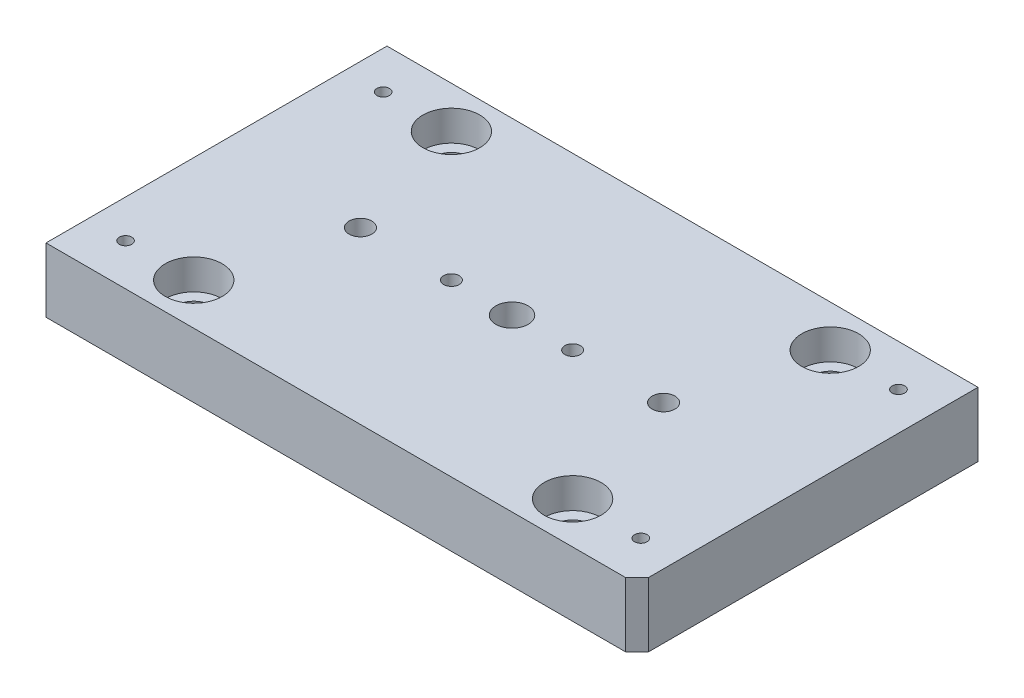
ISO-10303-21;
HEADER;
FILE_DESCRIPTION(('STEP AP214'),'2;1');
FILE_NAME('part.step','',(''),(''),'','','');
FILE_SCHEMA(('AUTOMOTIVE_DESIGN { 1 0 10303 214 1 1 1 1 }'));
ENDSEC;
DATA;
#1=APPLICATION_CONTEXT('core data for automotive mechanical design processes');
#2=APPLICATION_PROTOCOL_DEFINITION('international standard','automotive_design',2000,#1);
#3=PRODUCT_CONTEXT('',#1,'mechanical');
#4=PRODUCT('Part','Part','',(#3));
#5=PRODUCT_RELATED_PRODUCT_CATEGORY('part','',(#4));
#6=PRODUCT_DEFINITION_FORMATION('','',#4);
#7=PRODUCT_DEFINITION_CONTEXT('part definition',#1,'design');
#8=PRODUCT_DEFINITION('design','',#6,#7);
#9=PRODUCT_DEFINITION_SHAPE('','',#8);
#10=(LENGTH_UNIT() NAMED_UNIT(*) SI_UNIT(.MILLI.,.METRE.));
#11=(NAMED_UNIT(*) PLANE_ANGLE_UNIT() SI_UNIT($,.RADIAN.));
#12=(NAMED_UNIT(*) SI_UNIT($,.STERADIAN.) SOLID_ANGLE_UNIT());
#13=UNCERTAINTY_MEASURE_WITH_UNIT(LENGTH_MEASURE(1.E-05),#10,'distance_accuracy_value','');
#14=(GEOMETRIC_REPRESENTATION_CONTEXT(3) GLOBAL_UNCERTAINTY_ASSIGNED_CONTEXT((#13)) GLOBAL_UNIT_ASSIGNED_CONTEXT((#10,
#11,#12)) REPRESENTATION_CONTEXT('',''));
#15=CARTESIAN_POINT('',(0.,0.,0.));
#16=DIRECTION('',(0.,0.,1.));
#17=DIRECTION('',(1.,0.,0.));
#18=AXIS2_PLACEMENT_3D('',#15,#16,#17);
#19=CARTESIAN_POINT('',(0.,17.,0.));
#20=DIRECTION('',(0.,1.,0.));
#21=DIRECTION('',(0.,0.,1.));
#22=AXIS2_PLACEMENT_3D('',#19,#20,#21);
#23=CYLINDRICAL_SURFACE('',#22,4.24999999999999);
#24=CARTESIAN_POINT('',(0.,17.,0.));
#25=DIRECTION('',(0.,1.,0.));
#26=DIRECTION('',(0.,0.,1.));
#27=AXIS2_PLACEMENT_3D('',#24,#25,#26);
#28=CIRCLE('',#27,4.24999999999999);
#29=CARTESIAN_POINT('',(0.,17.,4.24999999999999));
#30=VERTEX_POINT('',#29);
#31=EDGE_CURVE('E163',#30,#30,#28,.T.);
#32=ORIENTED_EDGE('',*,*,#31,.T.);
#33=EDGE_LOOP('',(#32));
#34=FACE_BOUND('',#33,.T.);
#35=CARTESIAN_POINT('',(0.,4.,0.));
#36=DIRECTION('',(0.,-1.,0.));
#37=DIRECTION('',(0.,0.,-1.));
#38=AXIS2_PLACEMENT_3D('',#35,#36,#37);
#39=CIRCLE('',#38,4.24999999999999);
#40=CARTESIAN_POINT('',(0.,4.,-4.24999999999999));
#41=VERTEX_POINT('',#40);
#42=EDGE_CURVE('E170',#41,#41,#39,.F.);
#43=ORIENTED_EDGE('',*,*,#42,.F.);
#44=EDGE_LOOP('',(#43));
#45=FACE_BOUND('',#44,.T.);
#46=ADVANCED_FACE('F39',(#34,#45),#23,.F.);
#47=CARTESIAN_POINT('',(-16.,0.,0.));
#48=DIRECTION('',(0.,1.,0.));
#49=DIRECTION('',(0.,0.,1.));
#50=AXIS2_PLACEMENT_3D('',#47,#48,#49);
#51=CYLINDRICAL_SURFACE('',#50,2.05);
#52=CARTESIAN_POINT('',(-16.,17.,0.));
#53=DIRECTION('',(0.,1.,0.));
#54=DIRECTION('',(0.,0.,1.));
#55=AXIS2_PLACEMENT_3D('',#52,#53,#54);
#56=CIRCLE('',#55,2.05);
#57=CARTESIAN_POINT('',(-16.,17.,2.05));
#58=VERTEX_POINT('',#57);
#59=EDGE_CURVE('E543',#58,#58,#56,.T.);
#60=ORIENTED_EDGE('',*,*,#59,.T.);
#61=EDGE_LOOP('',(#60));
#62=FACE_BOUND('',#61,.T.);
#63=CARTESIAN_POINT('',(-16.,8.,0.));
#64=DIRECTION('',(0.,-1.,0.));
#65=DIRECTION('',(0.,0.,-1.));
#66=AXIS2_PLACEMENT_3D('',#63,#64,#65);
#67=CIRCLE('',#66,2.05);
#68=CARTESIAN_POINT('',(-16.,8.,-2.05));
#69=VERTEX_POINT('',#68);
#70=EDGE_CURVE('E165',#69,#69,#67,.F.);
#71=ORIENTED_EDGE('',*,*,#70,.F.);
#72=EDGE_LOOP('',(#71));
#73=FACE_BOUND('',#72,.T.);
#74=ADVANCED_FACE('F211',(#62,#73),#51,.F.);
#75=CARTESIAN_POINT('',(16.,0.,0.));
#76=DIRECTION('',(0.,1.,0.));
#77=DIRECTION('',(0.,0.,1.));
#78=AXIS2_PLACEMENT_3D('',#75,#76,#77);
#79=CYLINDRICAL_SURFACE('',#78,2.05);
#80=CARTESIAN_POINT('',(16.,17.,0.));
#81=DIRECTION('',(0.,1.,0.));
#82=DIRECTION('',(0.,0.,1.));
#83=AXIS2_PLACEMENT_3D('',#80,#81,#82);
#84=CIRCLE('',#83,2.05);
#85=CARTESIAN_POINT('',(16.,17.,2.05));
#86=VERTEX_POINT('',#85);
#87=EDGE_CURVE('E546',#86,#86,#84,.T.);
#88=ORIENTED_EDGE('',*,*,#87,.T.);
#89=EDGE_LOOP('',(#88));
#90=FACE_BOUND('',#89,.T.);
#91=CARTESIAN_POINT('',(16.,8.,0.));
#92=DIRECTION('',(0.,-1.,0.));
#93=DIRECTION('',(0.,0.,-1.));
#94=AXIS2_PLACEMENT_3D('',#91,#92,#93);
#95=CIRCLE('',#94,2.05);
#96=CARTESIAN_POINT('',(16.,8.,-2.05));
#97=VERTEX_POINT('',#96);
#98=EDGE_CURVE('E160',#97,#97,#95,.F.);
#99=ORIENTED_EDGE('',*,*,#98,.F.);
#100=EDGE_LOOP('',(#99));
#101=FACE_BOUND('',#100,.T.);
#102=ADVANCED_FACE('F217',(#90,#101),#79,.F.);
#103=CARTESIAN_POINT('',(-78.,17.,-45.));
#104=DIRECTION('',(1.,0.,0.));
#105=DIRECTION('',(0.,0.,-1.));
#106=AXIS2_PLACEMENT_3D('',#103,#104,#105);
#107=PLANE('',#106);
#108=DIRECTION('',(0.,0.,1.));
#109=VECTOR('',#108,1.);
#110=CARTESIAN_POINT('',(-78.,0.,-45.));
#111=LINE('',#110,#109);
#112=CARTESIAN_POINT('',(-78.,0.,-45.));
#113=VERTEX_POINT('',#112);
#114=CARTESIAN_POINT('',(-78.,0.,45.));
#115=VERTEX_POINT('',#114);
#116=EDGE_CURVE('E132',#113,#115,#111,.T.);
#117=ORIENTED_EDGE('',*,*,#116,.T.);
#118=DIRECTION('',(0.,-1.,0.));
#119=VECTOR('',#118,1.);
#120=CARTESIAN_POINT('',(-78.,17.,45.));
#121=LINE('',#120,#119);
#122=CARTESIAN_POINT('',(-78.,17.,45.));
#123=VERTEX_POINT('',#122);
#124=EDGE_CURVE('E156',#123,#115,#121,.T.);
#125=ORIENTED_EDGE('',*,*,#124,.F.);
#126=DIRECTION('',(0.,0.,1.));
#127=VECTOR('',#126,1.);
#128=CARTESIAN_POINT('',(-78.,17.,-45.));
#129=LINE('',#128,#127);
#130=CARTESIAN_POINT('',(-78.,17.,-45.));
#131=VERTEX_POINT('',#130);
#132=EDGE_CURVE('E141',#131,#123,#129,.T.);
#133=ORIENTED_EDGE('',*,*,#132,.F.);
#134=DIRECTION('',(0.,-1.,0.));
#135=VECTOR('',#134,1.);
#136=CARTESIAN_POINT('',(-78.,17.,-45.));
#137=LINE('',#136,#135);
#138=EDGE_CURVE('E150',#131,#113,#137,.T.);
#139=ORIENTED_EDGE('',*,*,#138,.T.);
#140=EDGE_LOOP('',(#117,#125,#133,#139));
#141=FACE_BOUND('',#140,.T.);
#142=ADVANCED_FACE('F193',(#141),#107,.F.);
#143=CARTESIAN_POINT('',(-78.,17.,45.));
#144=DIRECTION('',(0.,0.,-1.));
#145=DIRECTION('',(-1.,0.,0.));
#146=AXIS2_PLACEMENT_3D('',#143,#144,#145);
#147=PLANE('',#146);
#148=DIRECTION('',(1.,0.,0.));
#149=VECTOR('',#148,1.);
#150=CARTESIAN_POINT('',(-78.,0.,45.));
#151=LINE('',#150,#149);
#152=CARTESIAN_POINT('',(75.,0.,45.));
#153=VERTEX_POINT('',#152);
#154=EDGE_CURVE('E135',#115,#153,#151,.T.);
#155=ORIENTED_EDGE('',*,*,#154,.T.);
#156=DIRECTION('',(0.,1.,0.));
#157=VECTOR('',#156,1.);
#158=CARTESIAN_POINT('',(75.,17.,45.));
#159=LINE('',#158,#157);
#160=CARTESIAN_POINT('',(75.,17.,45.));
#161=VERTEX_POINT('',#160);
#162=EDGE_CURVE('E47',#153,#161,#159,.T.);
#163=ORIENTED_EDGE('',*,*,#162,.T.);
#164=DIRECTION('',(1.,0.,0.));
#165=VECTOR('',#164,1.);
#166=CARTESIAN_POINT('',(-78.,17.,45.));
#167=LINE('',#166,#165);
#168=EDGE_CURVE('E144',#123,#161,#167,.T.);
#169=ORIENTED_EDGE('',*,*,#168,.F.);
#170=ORIENTED_EDGE('',*,*,#124,.T.);
#171=EDGE_LOOP('',(#155,#163,#169,#170));
#172=FACE_BOUND('',#171,.T.);
#173=ADVANCED_FACE('F313',(#172),#147,.F.);
#174=CARTESIAN_POINT('',(78.,17.,-45.));
#175=DIRECTION('',(-1.,0.,0.));
#176=DIRECTION('',(0.,0.,1.));
#177=AXIS2_PLACEMENT_3D('',#174,#175,#176);
#178=PLANE('',#177);
#179=DIRECTION('',(0.,0.,-1.));
#180=VECTOR('',#179,1.);
#181=CARTESIAN_POINT('',(78.,17.,-45.));
#182=LINE('',#181,#180);
#183=CARTESIAN_POINT('',(78.,17.,42.));
#184=VERTEX_POINT('',#183);
#185=CARTESIAN_POINT('',(78.,17.,-45.));
#186=VERTEX_POINT('',#185);
#187=EDGE_CURVE('E146',#184,#186,#182,.T.);
#188=ORIENTED_EDGE('',*,*,#187,.F.);
#189=DIRECTION('',(0.,-1.,0.));
#190=VECTOR('',#189,1.);
#191=CARTESIAN_POINT('',(78.,17.,42.));
#192=LINE('',#191,#190);
#193=CARTESIAN_POINT('',(78.,0.,42.));
#194=VERTEX_POINT('',#193);
#195=EDGE_CURVE('E159',#184,#194,#192,.T.);
#196=ORIENTED_EDGE('',*,*,#195,.T.);
#197=DIRECTION('',(0.,0.,-1.));
#198=VECTOR('',#197,1.);
#199=CARTESIAN_POINT('',(78.,0.,-45.));
#200=LINE('',#199,#198);
#201=CARTESIAN_POINT('',(78.,0.,-45.));
#202=VERTEX_POINT('',#201);
#203=EDGE_CURVE('E137',#194,#202,#200,.T.);
#204=ORIENTED_EDGE('',*,*,#203,.T.);
#205=DIRECTION('',(0.,-1.,0.));
#206=VECTOR('',#205,1.);
#207=CARTESIAN_POINT('',(78.,17.,-45.));
#208=LINE('',#207,#206);
#209=EDGE_CURVE('E153',#186,#202,#208,.T.);
#210=ORIENTED_EDGE('',*,*,#209,.F.);
#211=EDGE_LOOP('',(#188,#196,#204,#210));
#212=FACE_BOUND('',#211,.T.);
#213=ADVANCED_FACE('F180',(#212),#178,.F.);
#214=CARTESIAN_POINT('',(-78.,17.,-45.));
#215=DIRECTION('',(0.,0.,1.));
#216=DIRECTION('',(1.,0.,0.));
#217=AXIS2_PLACEMENT_3D('',#214,#215,#216);
#218=PLANE('',#217);
#219=DIRECTION('',(-1.,0.,0.));
#220=VECTOR('',#219,1.);
#221=CARTESIAN_POINT('',(-78.,0.,-45.));
#222=LINE('',#221,#220);
#223=EDGE_CURVE('E139',#202,#113,#222,.T.);
#224=ORIENTED_EDGE('',*,*,#223,.T.);
#225=ORIENTED_EDGE('',*,*,#138,.F.);
#226=DIRECTION('',(-1.,0.,0.));
#227=VECTOR('',#226,1.);
#228=CARTESIAN_POINT('',(-78.,17.,-45.));
#229=LINE('',#228,#227);
#230=EDGE_CURVE('E148',#186,#131,#229,.T.);
#231=ORIENTED_EDGE('',*,*,#230,.F.);
#232=ORIENTED_EDGE('',*,*,#209,.T.);
#233=EDGE_LOOP('',(#224,#225,#231,#232));
#234=FACE_BOUND('',#233,.T.);
#235=ADVANCED_FACE('F189',(#234),#218,.F.);
#236=CARTESIAN_POINT('',(-78.,17.,45.));
#237=DIRECTION('',(0.,1.,0.));
#238=DIRECTION('',(0.,0.,1.));
#239=AXIS2_PLACEMENT_3D('',#236,#237,#238);
#240=PLANE('',#239);
#241=CARTESIAN_POINT('',(-40.,17.,0.));
#242=DIRECTION('',(0.,-1.,0.));
#243=DIRECTION('',(0.,0.,-1.));
#244=AXIS2_PLACEMENT_3D('',#241,#242,#243);
#245=CIRCLE('',#244,3.);
#246=CARTESIAN_POINT('',(-40.,17.,-3.));
#247=VERTEX_POINT('',#246);
#248=EDGE_CURVE('E516',#247,#247,#245,.T.);
#249=ORIENTED_EDGE('',*,*,#248,.T.);
#250=EDGE_LOOP('',(#249));
#251=FACE_BOUND('',#250,.T.);
#252=CARTESIAN_POINT('',(40.,17.,0.));
#253=DIRECTION('',(0.,-1.,0.));
#254=DIRECTION('',(0.,0.,-1.));
#255=AXIS2_PLACEMENT_3D('',#252,#253,#254);
#256=CIRCLE('',#255,3.);
#257=CARTESIAN_POINT('',(40.,17.,-3.));
#258=VERTEX_POINT('',#257);
#259=EDGE_CURVE('E524',#258,#258,#256,.T.);
#260=ORIENTED_EDGE('',*,*,#259,.T.);
#261=EDGE_LOOP('',(#260));
#262=FACE_BOUND('',#261,.T.);
#263=ORIENTED_EDGE('',*,*,#31,.F.);
#264=EDGE_LOOP('',(#263));
#265=FACE_BOUND('',#264,.T.);
#266=ORIENTED_EDGE('',*,*,#59,.F.);
#267=EDGE_LOOP('',(#266));
#268=FACE_BOUND('',#267,.T.);
#269=ORIENTED_EDGE('',*,*,#87,.F.);
#270=EDGE_LOOP('',(#269));
#271=FACE_BOUND('',#270,.T.);
#272=CARTESIAN_POINT('',(50.,17.,34.));
#273=DIRECTION('',(0.,1.,0.));
#274=DIRECTION('',(0.,0.,1.));
#275=AXIS2_PLACEMENT_3D('',#272,#273,#274);
#276=CIRCLE('',#275,7.5);
#277=CARTESIAN_POINT('',(50.,17.,41.5));
#278=VERTEX_POINT('',#277);
#279=EDGE_CURVE('E549',#278,#278,#276,.T.);
#280=ORIENTED_EDGE('',*,*,#279,.F.);
#281=EDGE_LOOP('',(#280));
#282=FACE_BOUND('',#281,.T.);
#283=CARTESIAN_POINT('',(50.,17.,-34.));
#284=DIRECTION('',(0.,1.,0.));
#285=DIRECTION('',(0.,0.,1.));
#286=AXIS2_PLACEMENT_3D('',#283,#284,#285);
#287=CIRCLE('',#286,7.5);
#288=CARTESIAN_POINT('',(50.,17.,-26.5));
#289=VERTEX_POINT('',#288);
#290=EDGE_CURVE('E561',#289,#289,#287,.T.);
#291=ORIENTED_EDGE('',*,*,#290,.F.);
#292=EDGE_LOOP('',(#291));
#293=FACE_BOUND('',#292,.T.);
#294=CARTESIAN_POINT('',(-50.,17.,-34.));
#295=DIRECTION('',(0.,1.,0.));
#296=DIRECTION('',(0.,0.,1.));
#297=AXIS2_PLACEMENT_3D('',#294,#295,#296);
#298=CIRCLE('',#297,7.5);
#299=CARTESIAN_POINT('',(-50.,17.,-26.5));
#300=VERTEX_POINT('',#299);
#301=EDGE_CURVE('E573',#300,#300,#298,.T.);
#302=ORIENTED_EDGE('',*,*,#301,.F.);
#303=EDGE_LOOP('',(#302));
#304=FACE_BOUND('',#303,.T.);
#305=CARTESIAN_POINT('',(-50.,17.,34.));
#306=DIRECTION('',(0.,1.,0.));
#307=DIRECTION('',(0.,0.,1.));
#308=AXIS2_PLACEMENT_3D('',#305,#306,#307);
#309=CIRCLE('',#308,7.5);
#310=CARTESIAN_POINT('',(-50.,17.,41.5));
#311=VERTEX_POINT('',#310);
#312=EDGE_CURVE('E585',#311,#311,#309,.T.);
#313=ORIENTED_EDGE('',*,*,#312,.F.);
#314=EDGE_LOOP('',(#313));
#315=FACE_BOUND('',#314,.T.);
#316=CARTESIAN_POINT('',(68.,17.,34.));
#317=DIRECTION('',(0.,1.,0.));
#318=DIRECTION('',(0.,0.,1.));
#319=AXIS2_PLACEMENT_3D('',#316,#317,#318);
#320=CIRCLE('',#319,1.65);
#321=CARTESIAN_POINT('',(68.,17.,35.65));
#322=VERTEX_POINT('',#321);
#323=EDGE_CURVE('E104',#322,#322,#320,.T.);
#324=ORIENTED_EDGE('',*,*,#323,.F.);
#325=EDGE_LOOP('',(#324));
#326=FACE_BOUND('',#325,.T.);
#327=CARTESIAN_POINT('',(68.,17.,-34.));
#328=DIRECTION('',(0.,1.,0.));
#329=DIRECTION('',(0.,0.,1.));
#330=AXIS2_PLACEMENT_3D('',#327,#328,#329);
#331=CIRCLE('',#330,1.65);
#332=CARTESIAN_POINT('',(68.,17.,-32.35));
#333=VERTEX_POINT('',#332);
#334=EDGE_CURVE('E117',#333,#333,#331,.T.);
#335=ORIENTED_EDGE('',*,*,#334,.F.);
#336=EDGE_LOOP('',(#335));
#337=FACE_BOUND('',#336,.T.);
#338=CARTESIAN_POINT('',(-68.,17.,-34.));
#339=DIRECTION('',(0.,1.,0.));
#340=DIRECTION('',(0.,0.,1.));
#341=AXIS2_PLACEMENT_3D('',#338,#339,#340);
#342=CIRCLE('',#341,1.65);
#343=CARTESIAN_POINT('',(-68.,17.,-32.35));
#344=VERTEX_POINT('',#343);
#345=EDGE_CURVE('E123',#344,#344,#342,.T.);
#346=ORIENTED_EDGE('',*,*,#345,.F.);
#347=EDGE_LOOP('',(#346));
#348=FACE_BOUND('',#347,.T.);
#349=CARTESIAN_POINT('',(-68.,17.,34.));
#350=DIRECTION('',(0.,1.,0.));
#351=DIRECTION('',(0.,0.,1.));
#352=AXIS2_PLACEMENT_3D('',#349,#350,#351);
#353=CIRCLE('',#352,1.65);
#354=CARTESIAN_POINT('',(-68.,17.,35.65));
#355=VERTEX_POINT('',#354);
#356=EDGE_CURVE('E129',#355,#355,#353,.T.);
#357=ORIENTED_EDGE('',*,*,#356,.F.);
#358=EDGE_LOOP('',(#357));
#359=FACE_BOUND('',#358,.T.);
#360=ORIENTED_EDGE('',*,*,#168,.T.);
#361=DIRECTION('',(-0.707106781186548,0.,0.707106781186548));
#362=VECTOR('',#361,1.);
#363=CARTESIAN_POINT('',(-1.5,17.,121.5));
#364=LINE('',#363,#362);
#365=EDGE_CURVE('E11',#161,#184,#364,.F.);
#366=ORIENTED_EDGE('',*,*,#365,.T.);
#367=ORIENTED_EDGE('',*,*,#187,.T.);
#368=ORIENTED_EDGE('',*,*,#230,.T.);
#369=ORIENTED_EDGE('',*,*,#132,.T.);
#370=EDGE_LOOP('',(#360,#366,#367,#368,#369));
#371=FACE_BOUND('',#370,.T.);
#372=ADVANCED_FACE('F196',(#251,#262,#265,#268,#271,#282,#293,#304,#315,#326,#337,#348,#359,
#371),#240,.T.);
#373=CARTESIAN_POINT('',(-78.,0.,45.));
#374=DIRECTION('',(0.,1.,0.));
#375=DIRECTION('',(0.,0.,1.));
#376=AXIS2_PLACEMENT_3D('',#373,#374,#375);
#377=PLANE('',#376);
#378=CARTESIAN_POINT('',(-40.,0.,0.));
#379=DIRECTION('',(0.,-1.,0.));
#380=DIRECTION('',(0.,0.,-1.));
#381=AXIS2_PLACEMENT_3D('',#378,#379,#380);
#382=CIRCLE('',#381,3.);
#383=CARTESIAN_POINT('',(-40.,0.,-3.));
#384=VERTEX_POINT('',#383);
#385=EDGE_CURVE('E519',#384,#384,#382,.T.);
#386=ORIENTED_EDGE('',*,*,#385,.F.);
#387=EDGE_LOOP('',(#386));
#388=FACE_BOUND('',#387,.T.);
#389=CARTESIAN_POINT('',(40.,0.,0.));
#390=DIRECTION('',(0.,-1.,0.));
#391=DIRECTION('',(0.,0.,-1.));
#392=AXIS2_PLACEMENT_3D('',#389,#390,#391);
#393=CIRCLE('',#392,3.);
#394=CARTESIAN_POINT('',(40.,0.,-3.));
#395=VERTEX_POINT('',#394);
#396=EDGE_CURVE('E521',#395,#395,#393,.T.);
#397=ORIENTED_EDGE('',*,*,#396,.F.);
#398=EDGE_LOOP('',(#397));
#399=FACE_BOUND('',#398,.T.);
#400=CARTESIAN_POINT('',(0.,0.,0.));
#401=DIRECTION('',(0.,-1.,0.));
#402=DIRECTION('',(0.,0.,-1.));
#403=AXIS2_PLACEMENT_3D('',#400,#401,#402);
#404=CIRCLE('',#403,6.75);
#405=CARTESIAN_POINT('',(0.,0.,-6.75));
#406=VERTEX_POINT('',#405);
#407=EDGE_CURVE('E527',#406,#406,#404,.T.);
#408=ORIENTED_EDGE('',*,*,#407,.F.);
#409=EDGE_LOOP('',(#408));
#410=FACE_BOUND('',#409,.T.);
#411=CARTESIAN_POINT('',(-16.,0.,0.));
#412=DIRECTION('',(0.,-1.,0.));
#413=DIRECTION('',(0.,0.,-1.));
#414=AXIS2_PLACEMENT_3D('',#411,#412,#413);
#415=CIRCLE('',#414,4.5);
#416=CARTESIAN_POINT('',(-16.,0.,-4.5));
#417=VERTEX_POINT('',#416);
#418=EDGE_CURVE('E173',#417,#417,#415,.T.);
#419=ORIENTED_EDGE('',*,*,#418,.F.);
#420=EDGE_LOOP('',(#419));
#421=FACE_BOUND('',#420,.T.);
#422=CARTESIAN_POINT('',(16.,0.,0.));
#423=DIRECTION('',(0.,-1.,0.));
#424=DIRECTION('',(0.,0.,-1.));
#425=AXIS2_PLACEMENT_3D('',#422,#423,#424);
#426=CIRCLE('',#425,4.5);
#427=CARTESIAN_POINT('',(16.,0.,-4.5));
#428=VERTEX_POINT('',#427);
#429=EDGE_CURVE('E168',#428,#428,#426,.T.);
#430=ORIENTED_EDGE('',*,*,#429,.F.);
#431=EDGE_LOOP('',(#430));
#432=FACE_BOUND('',#431,.T.);
#433=CARTESIAN_POINT('',(50.,0.,34.));
#434=DIRECTION('',(0.,1.,0.));
#435=DIRECTION('',(0.,0.,1.));
#436=AXIS2_PLACEMENT_3D('',#433,#434,#435);
#437=CIRCLE('',#436,4.5);
#438=CARTESIAN_POINT('',(50.,0.,38.5));
#439=VERTEX_POINT('',#438);
#440=EDGE_CURVE('E558',#439,#439,#437,.T.);
#441=ORIENTED_EDGE('',*,*,#440,.T.);
#442=EDGE_LOOP('',(#441));
#443=FACE_BOUND('',#442,.T.);
#444=CARTESIAN_POINT('',(50.,0.,-34.));
#445=DIRECTION('',(0.,1.,0.));
#446=DIRECTION('',(0.,0.,1.));
#447=AXIS2_PLACEMENT_3D('',#444,#445,#446);
#448=CIRCLE('',#447,4.5);
#449=CARTESIAN_POINT('',(50.,0.,-29.5));
#450=VERTEX_POINT('',#449);
#451=EDGE_CURVE('E570',#450,#450,#448,.T.);
#452=ORIENTED_EDGE('',*,*,#451,.T.);
#453=EDGE_LOOP('',(#452));
#454=FACE_BOUND('',#453,.T.);
#455=CARTESIAN_POINT('',(-50.,0.,-34.));
#456=DIRECTION('',(0.,1.,0.));
#457=DIRECTION('',(0.,0.,1.));
#458=AXIS2_PLACEMENT_3D('',#455,#456,#457);
#459=CIRCLE('',#458,4.5);
#460=CARTESIAN_POINT('',(-50.,0.,-29.5));
#461=VERTEX_POINT('',#460);
#462=EDGE_CURVE('E582',#461,#461,#459,.T.);
#463=ORIENTED_EDGE('',*,*,#462,.T.);
#464=EDGE_LOOP('',(#463));
#465=FACE_BOUND('',#464,.T.);
#466=CARTESIAN_POINT('',(-50.,0.,34.));
#467=DIRECTION('',(0.,1.,0.));
#468=DIRECTION('',(0.,0.,1.));
#469=AXIS2_PLACEMENT_3D('',#466,#467,#468);
#470=CIRCLE('',#469,4.5);
#471=CARTESIAN_POINT('',(-50.,0.,38.5));
#472=VERTEX_POINT('',#471);
#473=EDGE_CURVE('E105',#472,#472,#470,.T.);
#474=ORIENTED_EDGE('',*,*,#473,.T.);
#475=EDGE_LOOP('',(#474));
#476=FACE_BOUND('',#475,.T.);
#477=ORIENTED_EDGE('',*,*,#203,.F.);
#478=DIRECTION('',(0.707106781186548,0.,-0.707106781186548));
#479=VECTOR('',#478,1.);
#480=CARTESIAN_POINT('',(78.,0.,42.));
#481=LINE('',#480,#479);
#482=EDGE_CURVE('E61',#194,#153,#481,.F.);
#483=ORIENTED_EDGE('',*,*,#482,.T.);
#484=ORIENTED_EDGE('',*,*,#154,.F.);
#485=ORIENTED_EDGE('',*,*,#116,.F.);
#486=ORIENTED_EDGE('',*,*,#223,.F.);
#487=EDGE_LOOP('',(#477,#483,#484,#485,#486));
#488=FACE_BOUND('',#487,.T.);
#489=ADVANCED_FACE('F185',(#388,#399,#410,#421,#432,#443,#454,#465,#476,#488),#377,.F.);
#490=CARTESIAN_POINT('',(-68.,17.,34.));
#491=DIRECTION('',(0.,1.,0.));
#492=DIRECTION('',(0.,0.,1.));
#493=AXIS2_PLACEMENT_3D('',#490,#491,#492);
#494=CYLINDRICAL_SURFACE('',#493,1.65);
#495=CARTESIAN_POINT('',(-68.,6.9,34.));
#496=DIRECTION('',(0.,1.,0.));
#497=DIRECTION('',(0.,0.,1.));
#498=AXIS2_PLACEMENT_3D('',#495,#496,#497);
#499=CIRCLE('',#498,1.65);
#500=CARTESIAN_POINT('',(-68.,6.9,35.65));
#501=VERTEX_POINT('',#500);
#502=EDGE_CURVE('E126',#501,#501,#499,.T.);
#503=ORIENTED_EDGE('',*,*,#502,.F.);
#504=EDGE_LOOP('',(#503));
#505=FACE_BOUND('',#504,.T.);
#506=ORIENTED_EDGE('',*,*,#356,.T.);
#507=EDGE_LOOP('',(#506));
#508=FACE_BOUND('',#507,.T.);
#509=ADVANCED_FACE('F298',(#505,#508),#494,.F.);
#510=CARTESIAN_POINT('',(-68.,6.9,34.));
#511=DIRECTION('',(0.,1.,0.));
#512=DIRECTION('',(0.,0.,1.));
#513=AXIS2_PLACEMENT_3D('',#510,#511,#512);
#514=CONICAL_SURFACE('',#513,1.65,1.02974425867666);
#515=CARTESIAN_POINT('',(-68.,5.90857997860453,34.));
#516=VERTEX_POINT('',#515);
#517=VERTEX_LOOP('',#516);
#518=FACE_BOUND('',#517,.T.);
#519=ORIENTED_EDGE('',*,*,#502,.T.);
#520=EDGE_LOOP('',(#519));
#521=FACE_BOUND('',#520,.T.);
#522=ADVANCED_FACE('F294',(#518,#521),#514,.F.);
#523=CARTESIAN_POINT('',(-68.,17.,-34.));
#524=DIRECTION('',(0.,1.,0.));
#525=DIRECTION('',(0.,0.,1.));
#526=AXIS2_PLACEMENT_3D('',#523,#524,#525);
#527=CYLINDRICAL_SURFACE('',#526,1.65);
#528=CARTESIAN_POINT('',(-68.,6.9,-34.));
#529=DIRECTION('',(0.,1.,0.));
#530=DIRECTION('',(0.,0.,1.));
#531=AXIS2_PLACEMENT_3D('',#528,#529,#530);
#532=CIRCLE('',#531,1.65);
#533=CARTESIAN_POINT('',(-68.,6.9,-32.35));
#534=VERTEX_POINT('',#533);
#535=EDGE_CURVE('E120',#534,#534,#532,.T.);
#536=ORIENTED_EDGE('',*,*,#535,.F.);
#537=EDGE_LOOP('',(#536));
#538=FACE_BOUND('',#537,.T.);
#539=ORIENTED_EDGE('',*,*,#345,.T.);
#540=EDGE_LOOP('',(#539));
#541=FACE_BOUND('',#540,.T.);
#542=ADVANCED_FACE('F290',(#538,#541),#527,.F.);
#543=CARTESIAN_POINT('',(-68.,6.9,-34.));
#544=DIRECTION('',(0.,1.,0.));
#545=DIRECTION('',(0.,0.,1.));
#546=AXIS2_PLACEMENT_3D('',#543,#544,#545);
#547=CONICAL_SURFACE('',#546,1.65,1.02974425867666);
#548=CARTESIAN_POINT('',(-68.,5.90857997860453,-34.));
#549=VERTEX_POINT('',#548);
#550=VERTEX_LOOP('',#549);
#551=FACE_BOUND('',#550,.T.);
#552=ORIENTED_EDGE('',*,*,#535,.T.);
#553=EDGE_LOOP('',(#552));
#554=FACE_BOUND('',#553,.T.);
#555=ADVANCED_FACE('F286',(#551,#554),#547,.F.);
#556=CARTESIAN_POINT('',(68.,17.,-34.));
#557=DIRECTION('',(0.,1.,0.));
#558=DIRECTION('',(0.,0.,1.));
#559=AXIS2_PLACEMENT_3D('',#556,#557,#558);
#560=CYLINDRICAL_SURFACE('',#559,1.65);
#561=CARTESIAN_POINT('',(68.,6.9,-34.));
#562=DIRECTION('',(0.,1.,0.));
#563=DIRECTION('',(0.,0.,1.));
#564=AXIS2_PLACEMENT_3D('',#561,#562,#563);
#565=CIRCLE('',#564,1.65);
#566=CARTESIAN_POINT('',(68.,6.9,-32.35));
#567=VERTEX_POINT('',#566);
#568=EDGE_CURVE('E108',#567,#567,#565,.T.);
#569=ORIENTED_EDGE('',*,*,#568,.F.);
#570=EDGE_LOOP('',(#569));
#571=FACE_BOUND('',#570,.T.);
#572=ORIENTED_EDGE('',*,*,#334,.T.);
#573=EDGE_LOOP('',(#572));
#574=FACE_BOUND('',#573,.T.);
#575=ADVANCED_FACE('F282',(#571,#574),#560,.F.);
#576=CARTESIAN_POINT('',(68.,6.9,-34.));
#577=DIRECTION('',(0.,1.,0.));
#578=DIRECTION('',(0.,0.,1.));
#579=AXIS2_PLACEMENT_3D('',#576,#577,#578);
#580=CONICAL_SURFACE('',#579,1.65,1.02974425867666);
#581=CARTESIAN_POINT('',(68.,5.90857997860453,-34.));
#582=VERTEX_POINT('',#581);
#583=VERTEX_LOOP('',#582);
#584=FACE_BOUND('',#583,.T.);
#585=ORIENTED_EDGE('',*,*,#568,.T.);
#586=EDGE_LOOP('',(#585));
#587=FACE_BOUND('',#586,.T.);
#588=ADVANCED_FACE('F279',(#584,#587),#580,.F.);
#589=CARTESIAN_POINT('',(68.,17.,34.));
#590=DIRECTION('',(0.,1.,0.));
#591=DIRECTION('',(0.,0.,1.));
#592=AXIS2_PLACEMENT_3D('',#589,#590,#591);
#593=CYLINDRICAL_SURFACE('',#592,1.65);
#594=CARTESIAN_POINT('',(68.,6.9,34.));
#595=DIRECTION('',(0.,1.,0.));
#596=DIRECTION('',(0.,0.,1.));
#597=AXIS2_PLACEMENT_3D('',#594,#595,#596);
#598=CIRCLE('',#597,1.65);
#599=CARTESIAN_POINT('',(68.,6.9,35.65));
#600=VERTEX_POINT('',#599);
#601=EDGE_CURVE('E102',#600,#600,#598,.T.);
#602=ORIENTED_EDGE('',*,*,#601,.F.);
#603=EDGE_LOOP('',(#602));
#604=FACE_BOUND('',#603,.T.);
#605=ORIENTED_EDGE('',*,*,#323,.T.);
#606=EDGE_LOOP('',(#605));
#607=FACE_BOUND('',#606,.T.);
#608=ADVANCED_FACE('F98',(#604,#607),#593,.F.);
#609=CARTESIAN_POINT('',(68.,6.9,34.));
#610=DIRECTION('',(0.,1.,0.));
#611=DIRECTION('',(0.,0.,1.));
#612=AXIS2_PLACEMENT_3D('',#609,#610,#611);
#613=CONICAL_SURFACE('',#612,1.65,1.02974425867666);
#614=CARTESIAN_POINT('',(68.,5.90857997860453,34.));
#615=VERTEX_POINT('',#614);
#616=VERTEX_LOOP('',#615);
#617=FACE_BOUND('',#616,.T.);
#618=ORIENTED_EDGE('',*,*,#601,.T.);
#619=EDGE_LOOP('',(#618));
#620=FACE_BOUND('',#619,.T.);
#621=ADVANCED_FACE('F94',(#617,#620),#613,.F.);
#622=CARTESIAN_POINT('',(-50.,17.,34.));
#623=DIRECTION('',(0.,1.,0.));
#624=DIRECTION('',(0.,0.,1.));
#625=AXIS2_PLACEMENT_3D('',#622,#623,#624);
#626=CYLINDRICAL_SURFACE('',#625,4.5);
#627=ORIENTED_EDGE('',*,*,#473,.F.);
#628=EDGE_LOOP('',(#627));
#629=FACE_BOUND('',#628,.T.);
#630=CARTESIAN_POINT('',(-50.,9.,34.));
#631=DIRECTION('',(0.,1.,0.));
#632=DIRECTION('',(0.,0.,1.));
#633=AXIS2_PLACEMENT_3D('',#630,#631,#632);
#634=CIRCLE('',#633,4.5);
#635=CARTESIAN_POINT('',(-50.,9.,38.5));
#636=VERTEX_POINT('',#635);
#637=EDGE_CURVE('E111',#636,#636,#634,.T.);
#638=ORIENTED_EDGE('',*,*,#637,.T.);
#639=EDGE_LOOP('',(#638));
#640=FACE_BOUND('',#639,.T.);
#641=ADVANCED_FACE('F97',(#629,#640),#626,.F.);
#642=CARTESIAN_POINT('',(-45.5,9.,34.));
#643=DIRECTION('',(0.,-1.,0.));
#644=DIRECTION('',(0.,0.,-1.));
#645=AXIS2_PLACEMENT_3D('',#642,#643,#644);
#646=PLANE('',#645);
#647=ORIENTED_EDGE('',*,*,#637,.F.);
#648=EDGE_LOOP('',(#647));
#649=FACE_BOUND('',#648,.T.);
#650=CARTESIAN_POINT('',(-50.,9.,34.));
#651=DIRECTION('',(0.,1.,0.));
#652=DIRECTION('',(0.,0.,1.));
#653=AXIS2_PLACEMENT_3D('',#650,#651,#652);
#654=CIRCLE('',#653,7.5);
#655=CARTESIAN_POINT('',(-50.,9.,41.5));
#656=VERTEX_POINT('',#655);
#657=EDGE_CURVE('E588',#656,#656,#654,.T.);
#658=ORIENTED_EDGE('',*,*,#657,.T.);
#659=EDGE_LOOP('',(#658));
#660=FACE_BOUND('',#659,.T.);
#661=ADVANCED_FACE('F269',(#649,#660),#646,.F.);
#662=CARTESIAN_POINT('',(-50.,17.,34.));
#663=DIRECTION('',(0.,1.,0.));
#664=DIRECTION('',(0.,0.,1.));
#665=AXIS2_PLACEMENT_3D('',#662,#663,#664);
#666=CYLINDRICAL_SURFACE('',#665,7.5);
#667=ORIENTED_EDGE('',*,*,#657,.F.);
#668=EDGE_LOOP('',(#667));
#669=FACE_BOUND('',#668,.T.);
#670=ORIENTED_EDGE('',*,*,#312,.T.);
#671=EDGE_LOOP('',(#670));
#672=FACE_BOUND('',#671,.T.);
#673=ADVANCED_FACE('F265',(#669,#672),#666,.F.);
#674=CARTESIAN_POINT('',(-50.,17.,-34.));
#675=DIRECTION('',(0.,1.,0.));
#676=DIRECTION('',(0.,0.,1.));
#677=AXIS2_PLACEMENT_3D('',#674,#675,#676);
#678=CYLINDRICAL_SURFACE('',#677,4.5);
#679=ORIENTED_EDGE('',*,*,#462,.F.);
#680=EDGE_LOOP('',(#679));
#681=FACE_BOUND('',#680,.T.);
#682=CARTESIAN_POINT('',(-50.,9.,-34.));
#683=DIRECTION('',(0.,1.,0.));
#684=DIRECTION('',(0.,0.,1.));
#685=AXIS2_PLACEMENT_3D('',#682,#683,#684);
#686=CIRCLE('',#685,4.5);
#687=CARTESIAN_POINT('',(-50.,9.,-29.5));
#688=VERTEX_POINT('',#687);
#689=EDGE_CURVE('E579',#688,#688,#686,.T.);
#690=ORIENTED_EDGE('',*,*,#689,.T.);
#691=EDGE_LOOP('',(#690));
#692=FACE_BOUND('',#691,.T.);
#693=ADVANCED_FACE('F261',(#681,#692),#678,.F.);
#694=CARTESIAN_POINT('',(-45.5,9.,-34.));
#695=DIRECTION('',(0.,-1.,0.));
#696=DIRECTION('',(0.,0.,-1.));
#697=AXIS2_PLACEMENT_3D('',#694,#695,#696);
#698=PLANE('',#697);
#699=ORIENTED_EDGE('',*,*,#689,.F.);
#700=EDGE_LOOP('',(#699));
#701=FACE_BOUND('',#700,.T.);
#702=CARTESIAN_POINT('',(-50.,9.,-34.));
#703=DIRECTION('',(0.,1.,0.));
#704=DIRECTION('',(0.,0.,1.));
#705=AXIS2_PLACEMENT_3D('',#702,#703,#704);
#706=CIRCLE('',#705,7.5);
#707=CARTESIAN_POINT('',(-50.,9.,-26.5));
#708=VERTEX_POINT('',#707);
#709=EDGE_CURVE('E576',#708,#708,#706,.T.);
#710=ORIENTED_EDGE('',*,*,#709,.T.);
#711=EDGE_LOOP('',(#710));
#712=FACE_BOUND('',#711,.T.);
#713=ADVANCED_FACE('F257',(#701,#712),#698,.F.);
#714=CARTESIAN_POINT('',(-50.,17.,-34.));
#715=DIRECTION('',(0.,1.,0.));
#716=DIRECTION('',(0.,0.,1.));
#717=AXIS2_PLACEMENT_3D('',#714,#715,#716);
#718=CYLINDRICAL_SURFACE('',#717,7.5);
#719=ORIENTED_EDGE('',*,*,#709,.F.);
#720=EDGE_LOOP('',(#719));
#721=FACE_BOUND('',#720,.T.);
#722=ORIENTED_EDGE('',*,*,#301,.T.);
#723=EDGE_LOOP('',(#722));
#724=FACE_BOUND('',#723,.T.);
#725=ADVANCED_FACE('F253',(#721,#724),#718,.F.);
#726=CARTESIAN_POINT('',(50.,17.,-34.));
#727=DIRECTION('',(0.,1.,0.));
#728=DIRECTION('',(0.,0.,1.));
#729=AXIS2_PLACEMENT_3D('',#726,#727,#728);
#730=CYLINDRICAL_SURFACE('',#729,4.5);
#731=ORIENTED_EDGE('',*,*,#451,.F.);
#732=EDGE_LOOP('',(#731));
#733=FACE_BOUND('',#732,.T.);
#734=CARTESIAN_POINT('',(50.,9.,-34.));
#735=DIRECTION('',(0.,1.,0.));
#736=DIRECTION('',(0.,0.,1.));
#737=AXIS2_PLACEMENT_3D('',#734,#735,#736);
#738=CIRCLE('',#737,4.5);
#739=CARTESIAN_POINT('',(50.,9.,-29.5));
#740=VERTEX_POINT('',#739);
#741=EDGE_CURVE('E567',#740,#740,#738,.T.);
#742=ORIENTED_EDGE('',*,*,#741,.T.);
#743=EDGE_LOOP('',(#742));
#744=FACE_BOUND('',#743,.T.);
#745=ADVANCED_FACE('F249',(#733,#744),#730,.F.);
#746=CARTESIAN_POINT('',(54.5,9.,-34.));
#747=DIRECTION('',(0.,-1.,0.));
#748=DIRECTION('',(0.,0.,-1.));
#749=AXIS2_PLACEMENT_3D('',#746,#747,#748);
#750=PLANE('',#749);
#751=ORIENTED_EDGE('',*,*,#741,.F.);
#752=EDGE_LOOP('',(#751));
#753=FACE_BOUND('',#752,.T.);
#754=CARTESIAN_POINT('',(50.,9.,-34.));
#755=DIRECTION('',(0.,1.,0.));
#756=DIRECTION('',(0.,0.,1.));
#757=AXIS2_PLACEMENT_3D('',#754,#755,#756);
#758=CIRCLE('',#757,7.5);
#759=CARTESIAN_POINT('',(50.,9.,-26.5));
#760=VERTEX_POINT('',#759);
#761=EDGE_CURVE('E564',#760,#760,#758,.T.);
#762=ORIENTED_EDGE('',*,*,#761,.T.);
#763=EDGE_LOOP('',(#762));
#764=FACE_BOUND('',#763,.T.);
#765=ADVANCED_FACE('F245',(#753,#764),#750,.F.);
#766=CARTESIAN_POINT('',(50.,17.,-34.));
#767=DIRECTION('',(0.,1.,0.));
#768=DIRECTION('',(0.,0.,1.));
#769=AXIS2_PLACEMENT_3D('',#766,#767,#768);
#770=CYLINDRICAL_SURFACE('',#769,7.5);
#771=ORIENTED_EDGE('',*,*,#761,.F.);
#772=EDGE_LOOP('',(#771));
#773=FACE_BOUND('',#772,.T.);
#774=ORIENTED_EDGE('',*,*,#290,.T.);
#775=EDGE_LOOP('',(#774));
#776=FACE_BOUND('',#775,.T.);
#777=ADVANCED_FACE('F241',(#773,#776),#770,.F.);
#778=CARTESIAN_POINT('',(50.,17.,34.));
#779=DIRECTION('',(0.,1.,0.));
#780=DIRECTION('',(0.,0.,1.));
#781=AXIS2_PLACEMENT_3D('',#778,#779,#780);
#782=CYLINDRICAL_SURFACE('',#781,4.5);
#783=ORIENTED_EDGE('',*,*,#440,.F.);
#784=EDGE_LOOP('',(#783));
#785=FACE_BOUND('',#784,.T.);
#786=CARTESIAN_POINT('',(50.,9.,34.));
#787=DIRECTION('',(0.,1.,0.));
#788=DIRECTION('',(0.,0.,1.));
#789=AXIS2_PLACEMENT_3D('',#786,#787,#788);
#790=CIRCLE('',#789,4.5);
#791=CARTESIAN_POINT('',(50.,9.,38.5));
#792=VERTEX_POINT('',#791);
#793=EDGE_CURVE('E555',#792,#792,#790,.T.);
#794=ORIENTED_EDGE('',*,*,#793,.T.);
#795=EDGE_LOOP('',(#794));
#796=FACE_BOUND('',#795,.T.);
#797=ADVANCED_FACE('F237',(#785,#796),#782,.F.);
#798=CARTESIAN_POINT('',(54.5,9.,34.));
#799=DIRECTION('',(0.,-1.,0.));
#800=DIRECTION('',(0.,0.,-1.));
#801=AXIS2_PLACEMENT_3D('',#798,#799,#800);
#802=PLANE('',#801);
#803=ORIENTED_EDGE('',*,*,#793,.F.);
#804=EDGE_LOOP('',(#803));
#805=FACE_BOUND('',#804,.T.);
#806=CARTESIAN_POINT('',(50.,9.,34.));
#807=DIRECTION('',(0.,1.,0.));
#808=DIRECTION('',(0.,0.,1.));
#809=AXIS2_PLACEMENT_3D('',#806,#807,#808);
#810=CIRCLE('',#809,7.5);
#811=CARTESIAN_POINT('',(50.,9.,41.5));
#812=VERTEX_POINT('',#811);
#813=EDGE_CURVE('E552',#812,#812,#810,.T.);
#814=ORIENTED_EDGE('',*,*,#813,.T.);
#815=EDGE_LOOP('',(#814));
#816=FACE_BOUND('',#815,.T.);
#817=ADVANCED_FACE('F233',(#805,#816),#802,.F.);
#818=CARTESIAN_POINT('',(50.,17.,34.));
#819=DIRECTION('',(0.,1.,0.));
#820=DIRECTION('',(0.,0.,1.));
#821=AXIS2_PLACEMENT_3D('',#818,#819,#820);
#822=CYLINDRICAL_SURFACE('',#821,7.5);
#823=ORIENTED_EDGE('',*,*,#813,.F.);
#824=EDGE_LOOP('',(#823));
#825=FACE_BOUND('',#824,.T.);
#826=ORIENTED_EDGE('',*,*,#279,.T.);
#827=EDGE_LOOP('',(#826));
#828=FACE_BOUND('',#827,.T.);
#829=ADVANCED_FACE('F229',(#825,#828),#822,.F.);
#830=CARTESIAN_POINT('',(16.,8.,0.));
#831=DIRECTION('',(0.,-1.,0.));
#832=DIRECTION('',(0.,0.,-1.));
#833=AXIS2_PLACEMENT_3D('',#830,#831,#832);
#834=PLANE('',#833);
#835=CARTESIAN_POINT('',(16.,8.,0.));
#836=DIRECTION('',(0.,-1.,0.));
#837=DIRECTION('',(0.,0.,-1.));
#838=AXIS2_PLACEMENT_3D('',#835,#836,#837);
#839=CIRCLE('',#838,4.5);
#840=CARTESIAN_POINT('',(16.,8.,-4.5));
#841=VERTEX_POINT('',#840);
#842=EDGE_CURVE('E164',#841,#841,#839,.T.);
#843=ORIENTED_EDGE('',*,*,#842,.T.);
#844=EDGE_LOOP('',(#843));
#845=FACE_BOUND('',#844,.T.);
#846=ORIENTED_EDGE('',*,*,#98,.T.);
#847=EDGE_LOOP('',(#846));
#848=FACE_BOUND('',#847,.T.);
#849=ADVANCED_FACE('F232',(#845,#848),#834,.T.);
#850=CARTESIAN_POINT('',(16.,8.,0.));
#851=DIRECTION('',(0.,-1.,0.));
#852=DIRECTION('',(0.,0.,-1.));
#853=AXIS2_PLACEMENT_3D('',#850,#851,#852);
#854=CYLINDRICAL_SURFACE('',#853,4.5);
#855=ORIENTED_EDGE('',*,*,#842,.F.);
#856=EDGE_LOOP('',(#855));
#857=FACE_BOUND('',#856,.T.);
#858=ORIENTED_EDGE('',*,*,#429,.T.);
#859=EDGE_LOOP('',(#858));
#860=FACE_BOUND('',#859,.T.);
#861=ADVANCED_FACE('F223',(#857,#860),#854,.F.);
#862=CARTESIAN_POINT('',(-16.,8.,0.));
#863=DIRECTION('',(0.,-1.,0.));
#864=DIRECTION('',(0.,0.,-1.));
#865=AXIS2_PLACEMENT_3D('',#862,#863,#864);
#866=PLANE('',#865);
#867=CARTESIAN_POINT('',(-16.,8.,0.));
#868=DIRECTION('',(0.,-1.,0.));
#869=DIRECTION('',(0.,0.,-1.));
#870=AXIS2_PLACEMENT_3D('',#867,#868,#869);
#871=CIRCLE('',#870,4.5);
#872=CARTESIAN_POINT('',(-16.,8.,-4.5));
#873=VERTEX_POINT('',#872);
#874=EDGE_CURVE('E169',#873,#873,#871,.T.);
#875=ORIENTED_EDGE('',*,*,#874,.T.);
#876=EDGE_LOOP('',(#875));
#877=FACE_BOUND('',#876,.T.);
#878=ORIENTED_EDGE('',*,*,#70,.T.);
#879=EDGE_LOOP('',(#878));
#880=FACE_BOUND('',#879,.T.);
#881=ADVANCED_FACE('F434',(#877,#880),#866,.T.);
#882=CARTESIAN_POINT('',(-16.,8.,0.));
#883=DIRECTION('',(0.,-1.,0.));
#884=DIRECTION('',(0.,0.,-1.));
#885=AXIS2_PLACEMENT_3D('',#882,#883,#884);
#886=CYLINDRICAL_SURFACE('',#885,4.5);
#887=ORIENTED_EDGE('',*,*,#874,.F.);
#888=EDGE_LOOP('',(#887));
#889=FACE_BOUND('',#888,.T.);
#890=ORIENTED_EDGE('',*,*,#418,.T.);
#891=EDGE_LOOP('',(#890));
#892=FACE_BOUND('',#891,.T.);
#893=ADVANCED_FACE('F441',(#889,#892),#886,.F.);
#894=CARTESIAN_POINT('',(0.,4.,0.));
#895=DIRECTION('',(0.,-1.,0.));
#896=DIRECTION('',(0.,0.,-1.));
#897=AXIS2_PLACEMENT_3D('',#894,#895,#896);
#898=PLANE('',#897);
#899=CARTESIAN_POINT('',(0.,4.,0.));
#900=DIRECTION('',(0.,-1.,0.));
#901=DIRECTION('',(0.,0.,-1.));
#902=AXIS2_PLACEMENT_3D('',#899,#900,#901);
#903=CIRCLE('',#902,6.75);
#904=CARTESIAN_POINT('',(0.,4.,-6.75));
#905=VERTEX_POINT('',#904);
#906=EDGE_CURVE('E174',#905,#905,#903,.T.);
#907=ORIENTED_EDGE('',*,*,#906,.T.);
#908=EDGE_LOOP('',(#907));
#909=FACE_BOUND('',#908,.T.);
#910=ORIENTED_EDGE('',*,*,#42,.T.);
#911=EDGE_LOOP('',(#910));
#912=FACE_BOUND('',#911,.T.);
#913=ADVANCED_FACE('F207',(#909,#912),#898,.T.);
#914=CARTESIAN_POINT('',(0.,4.,0.));
#915=DIRECTION('',(0.,-1.,0.));
#916=DIRECTION('',(0.,0.,-1.));
#917=AXIS2_PLACEMENT_3D('',#914,#915,#916);
#918=CYLINDRICAL_SURFACE('',#917,6.75);
#919=ORIENTED_EDGE('',*,*,#906,.F.);
#920=EDGE_LOOP('',(#919));
#921=FACE_BOUND('',#920,.T.);
#922=ORIENTED_EDGE('',*,*,#407,.T.);
#923=EDGE_LOOP('',(#922));
#924=FACE_BOUND('',#923,.T.);
#925=ADVANCED_FACE('F199',(#921,#924),#918,.F.);
#926=CARTESIAN_POINT('',(78.,17.,42.));
#927=DIRECTION('',(-0.707106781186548,0.,-0.707106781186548));
#928=DIRECTION('',(-0.707106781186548,0.,0.707106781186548));
#929=AXIS2_PLACEMENT_3D('',#926,#927,#928);
#930=PLANE('',#929);
#931=ORIENTED_EDGE('',*,*,#365,.F.);
#932=ORIENTED_EDGE('',*,*,#162,.F.);
#933=ORIENTED_EDGE('',*,*,#482,.F.);
#934=ORIENTED_EDGE('',*,*,#195,.F.);
#935=EDGE_LOOP('',(#931,#932,#933,#934));
#936=FACE_BOUND('',#935,.T.);
#937=ADVANCED_FACE('F41',(#936),#930,.F.);
#938=CARTESIAN_POINT('',(40.,17.,0.));
#939=DIRECTION('',(0.,-1.,0.));
#940=DIRECTION('',(0.,0.,-1.));
#941=AXIS2_PLACEMENT_3D('',#938,#939,#940);
#942=CYLINDRICAL_SURFACE('',#941,3.);
#943=ORIENTED_EDGE('',*,*,#259,.F.);
#944=EDGE_LOOP('',(#943));
#945=FACE_BOUND('',#944,.T.);
#946=ORIENTED_EDGE('',*,*,#396,.T.);
#947=EDGE_LOOP('',(#946));
#948=FACE_BOUND('',#947,.T.);
#949=ADVANCED_FACE('F198',(#945,#948),#942,.F.);
#950=CARTESIAN_POINT('',(-40.,17.,0.));
#951=DIRECTION('',(0.,-1.,0.));
#952=DIRECTION('',(0.,0.,-1.));
#953=AXIS2_PLACEMENT_3D('',#950,#951,#952);
#954=CYLINDRICAL_SURFACE('',#953,3.);
#955=ORIENTED_EDGE('',*,*,#248,.F.);
#956=EDGE_LOOP('',(#955));
#957=FACE_BOUND('',#956,.T.);
#958=ORIENTED_EDGE('',*,*,#385,.T.);
#959=EDGE_LOOP('',(#958));
#960=FACE_BOUND('',#959,.T.);
#961=ADVANCED_FACE('F204',(#957,#960),#954,.F.);
#962=CLOSED_SHELL('',(#46,#74,#102,#142,#173,#213,#235,#372,#489,#509,#522,#542,#555,#575,#588,
#608,#621,#641,#661,#673,#693,#713,#725,#745,#765,#777,#797,#817,#829,#849,#861,#881,#893,#913,
#925,#937,#949,#961));
#963=MANIFOLD_SOLID_BREP('B2',#962);
#964=ADVANCED_BREP_SHAPE_REPRESENTATION('',(#18,#963),#14);
#965=SHAPE_DEFINITION_REPRESENTATION(#9,#964);
ENDSEC;
END-ISO-10303-21;
